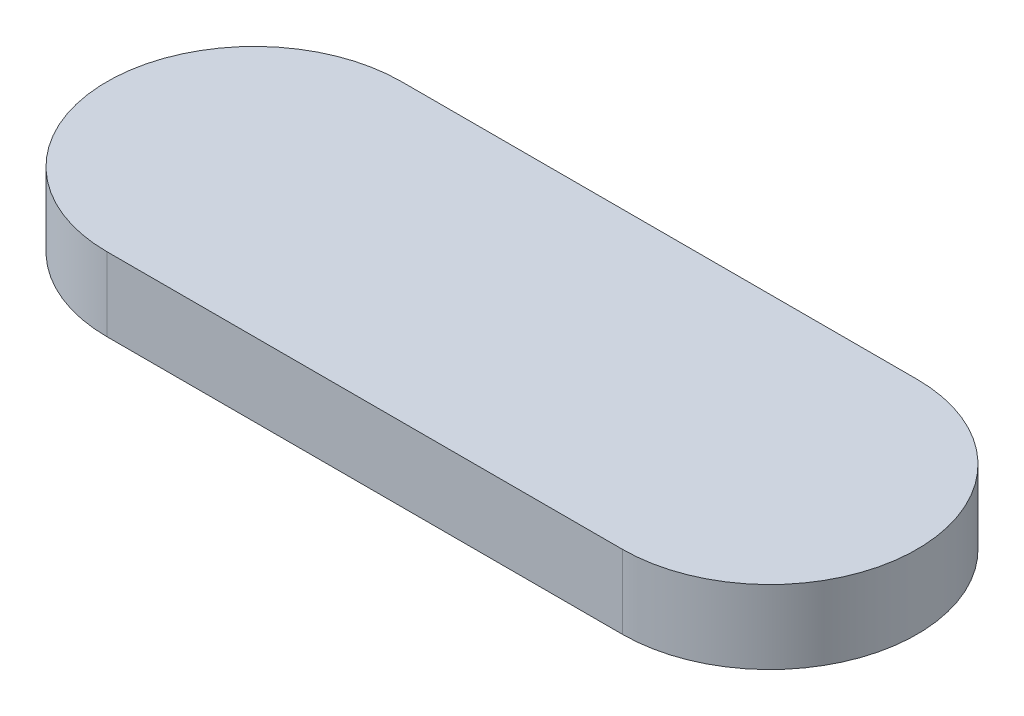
from build123d import *

# Parameters (mm, degrees)
EXTRUDE1_DEPTH = 5


with BuildPart() as part:
    # Sketch1 → Extrude1 (new body)
    with BuildSketch(Plane(origin=(0, 0, 0), x_dir=(1, 0, 0), z_dir=(0, 1, 0))):
        with BuildLine():
            Line((0, -10), (35, -10))
            ThreePointArc((35, -10), (45, 0), (35, 10))
            Line((35, 10), (0, 10))
            ThreePointArc((0, 10), (-10, 0), (0, -10))
        make_face()
    extrude(amount=EXTRUDE1_DEPTH)


solid = part.part
